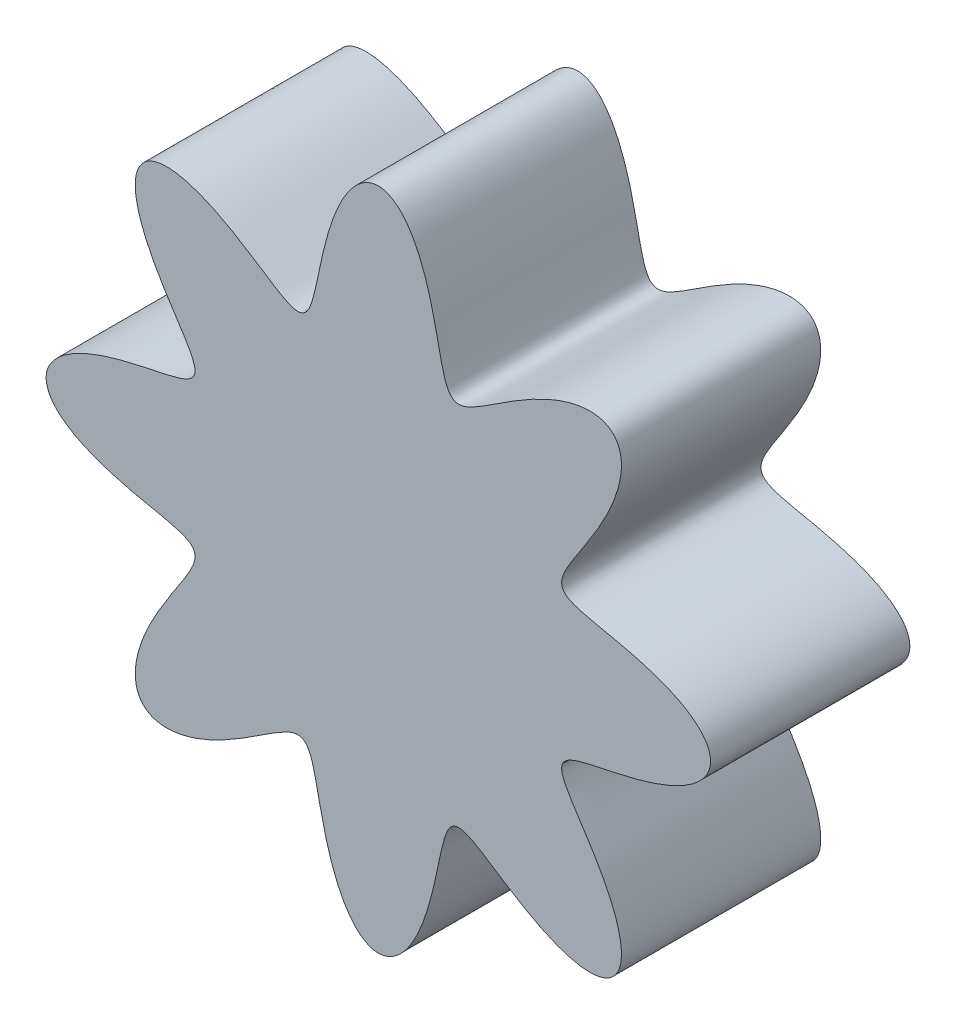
ISO-10303-21;
HEADER;
FILE_DESCRIPTION(('STEP AP214'),'2;1');
FILE_NAME('part.step','',(''),(''),'','','');
FILE_SCHEMA(('AUTOMOTIVE_DESIGN { 1 0 10303 214 1 1 1 1 }'));
ENDSEC;
DATA;
#1=APPLICATION_CONTEXT('core data for automotive mechanical design processes');
#2=APPLICATION_PROTOCOL_DEFINITION('international standard','automotive_design',2000,#1);
#3=PRODUCT_CONTEXT('',#1,'mechanical');
#4=PRODUCT('Part','Part','',(#3));
#5=PRODUCT_RELATED_PRODUCT_CATEGORY('part','',(#4));
#6=PRODUCT_DEFINITION_FORMATION('','',#4);
#7=PRODUCT_DEFINITION_CONTEXT('part definition',#1,'design');
#8=PRODUCT_DEFINITION('design','',#6,#7);
#9=PRODUCT_DEFINITION_SHAPE('','',#8);
#10=(LENGTH_UNIT() NAMED_UNIT(*) SI_UNIT(.MILLI.,.METRE.));
#11=(NAMED_UNIT(*) PLANE_ANGLE_UNIT() SI_UNIT($,.RADIAN.));
#12=(NAMED_UNIT(*) SI_UNIT($,.STERADIAN.) SOLID_ANGLE_UNIT());
#13=UNCERTAINTY_MEASURE_WITH_UNIT(LENGTH_MEASURE(1.E-05),#10,'distance_accuracy_value','');
#14=(GEOMETRIC_REPRESENTATION_CONTEXT(3) GLOBAL_UNCERTAINTY_ASSIGNED_CONTEXT((#13)) GLOBAL_UNIT_ASSIGNED_CONTEXT((#10,
#11,#12)) REPRESENTATION_CONTEXT('',''));
#15=CARTESIAN_POINT('',(0.,0.,0.));
#16=DIRECTION('',(0.,0.,1.));
#17=DIRECTION('',(1.,0.,0.));
#18=AXIS2_PLACEMENT_3D('',#15,#16,#17);
#19=CARTESIAN_POINT('',(127.,0.,38.1));
#20=CARTESIAN_POINT('',(127.,0.744327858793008,38.1));
#21=CARTESIAN_POINT('',(126.812104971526,2.26553497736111,38.1));
#22=CARTESIAN_POINT('',(125.986272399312,4.48764733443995,38.1));
#23=CARTESIAN_POINT('',(124.645591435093,6.63682299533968,38.1));
#24=CARTESIAN_POINT('',(122.825734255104,8.69471257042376,38.1));
#25=CARTESIAN_POINT('',(120.564985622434,10.6467449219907,38.1));
#26=CARTESIAN_POINT('',(117.906803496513,12.4795993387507,38.1));
#27=CARTESIAN_POINT('',(114.901276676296,14.1817557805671,38.1));
#28=CARTESIAN_POINT('',(111.605029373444,15.7446854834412,38.1));
#29=CARTESIAN_POINT('',(108.080250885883,17.1638059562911,38.1));
#30=CARTESIAN_POINT('',(104.393338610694,18.439077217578,38.1));
#31=CARTESIAN_POINT('',(100.613380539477,19.5752934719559,38.1));
#32=CARTESIAN_POINT('',(96.8105770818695,20.5821323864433,38.1));
#33=CARTESIAN_POINT('',(93.0546510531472,21.4740014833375,38.1));
#34=CARTESIAN_POINT('',(89.413276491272,22.2697095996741,38.1));
#35=CARTESIAN_POINT('',(85.950544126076,22.9919797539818,38.1));
#36=CARTESIAN_POINT('',(82.7254677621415,23.6668333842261,38.1));
#37=CARTESIAN_POINT('',(79.7904980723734,24.3228607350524,38.1));
#38=CARTESIAN_POINT('',(77.1899683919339,24.9905710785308,38.1));
#39=CARTESIAN_POINT('',(74.9582472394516,25.7018944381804,38.1));
#40=CARTESIAN_POINT('',(73.1177427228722,26.4917881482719,38.1));
#41=CARTESIAN_POINT('',(71.6787113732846,27.4021927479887,38.1));
#42=CARTESIAN_POINT('',(70.6559272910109,28.4955537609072,38.1));
#43=CARTESIAN_POINT('',(70.1106846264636,29.8118860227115,38.1));
#44=CARTESIAN_POINT('',(70.0607791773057,31.3082265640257,38.1));
#45=CARTESIAN_POINT('',(70.4345747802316,32.9695286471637,38.1));
#46=CARTESIAN_POINT('',(71.1774687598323,34.8295010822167,38.1));
#47=CARTESIAN_POINT('',(72.2525524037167,36.910547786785,38.1));
#48=CARTESIAN_POINT('',(73.6192620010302,39.221542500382,38.1));
#49=CARTESIAN_POINT('',(75.2307176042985,41.7607608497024,38.1));
#50=CARTESIAN_POINT('',(77.0339973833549,44.5184278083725,38.1));
#51=CARTESIAN_POINT('',(78.9717968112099,47.4776714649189,38.1));
#52=CARTESIAN_POINT('',(80.9839868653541,50.6151627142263,38.1));
#53=CARTESIAN_POINT('',(83.0091809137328,53.9016501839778,38.1));
#54=CARTESIAN_POINT('',(84.9862264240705,57.3025808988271,38.1));
#55=CARTESIAN_POINT('',(86.8556341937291,60.7788410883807,38.1));
#56=CARTESIAN_POINT('',(88.5609218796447,64.2876347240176,38.1));
#57=CARTESIAN_POINT('',(90.0498469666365,67.7834991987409,38.1));
#58=CARTESIAN_POINT('',(91.2754875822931,71.2194562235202,38.1));
#59=CARTESIAN_POINT('',(92.1971096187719,74.5482909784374,38.1));
#60=CARTESIAN_POINT('',(92.7807044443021,77.7239333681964,38.1));
#61=CARTESIAN_POINT('',(92.9989998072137,80.7028193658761,38.1));
#62=CARTESIAN_POINT('',(92.8306855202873,83.444800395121,38.1));
#63=CARTESIAN_POINT('',(92.2589934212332,85.9125016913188,38.1));
#64=CARTESIAN_POINT('',(91.2716744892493,88.0677242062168,38.1));
#65=CARTESIAN_POINT('',(89.8675706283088,89.8675706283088,38.1));
#66=CARTESIAN_POINT('',(88.0677242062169,91.2716744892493,38.1));
#67=CARTESIAN_POINT('',(85.9125016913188,92.2589934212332,38.1));
#68=CARTESIAN_POINT('',(83.444800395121,92.8306855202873,38.1));
#69=CARTESIAN_POINT('',(80.7028193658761,92.9989998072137,38.1));
#70=CARTESIAN_POINT('',(77.7239333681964,92.780704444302,38.1));
#71=CARTESIAN_POINT('',(74.5482909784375,92.1971096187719,38.1));
#72=CARTESIAN_POINT('',(71.2194562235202,91.275487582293,38.1));
#73=CARTESIAN_POINT('',(67.7834991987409,90.0498469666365,38.1));
#74=CARTESIAN_POINT('',(64.2876347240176,88.5609218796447,38.1));
#75=CARTESIAN_POINT('',(60.7788410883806,86.855634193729,38.1));
#76=CARTESIAN_POINT('',(57.3025808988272,84.9862264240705,38.1));
#77=CARTESIAN_POINT('',(53.9016501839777,83.0091809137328,38.1));
#78=CARTESIAN_POINT('',(50.6151627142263,80.9839868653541,38.1));
#79=CARTESIAN_POINT('',(47.477671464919,78.97179681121,38.1));
#80=CARTESIAN_POINT('',(44.5184278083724,77.0339973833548,38.1));
#81=CARTESIAN_POINT('',(41.7607608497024,75.2307176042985,38.1));
#82=CARTESIAN_POINT('',(39.221542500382,73.6192620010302,38.1));
#83=CARTESIAN_POINT('',(36.910547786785,72.2525524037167,38.1));
#84=CARTESIAN_POINT('',(34.8295010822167,71.1774687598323,38.1));
#85=CARTESIAN_POINT('',(32.9695286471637,70.4345747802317,38.1));
#86=CARTESIAN_POINT('',(31.3082265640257,70.0607791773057,38.1));
#87=CARTESIAN_POINT('',(29.8118860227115,70.1106846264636,38.1));
#88=CARTESIAN_POINT('',(28.4955537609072,70.655927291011,38.1));
#89=CARTESIAN_POINT('',(27.4021927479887,71.6787113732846,38.1));
#90=CARTESIAN_POINT('',(26.4917881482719,73.1177427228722,38.1));
#91=CARTESIAN_POINT('',(25.7018944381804,74.9582472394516,38.1));
#92=CARTESIAN_POINT('',(24.9905710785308,77.1899683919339,38.1));
#93=CARTESIAN_POINT('',(24.3228607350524,79.7904980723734,38.1));
#94=CARTESIAN_POINT('',(23.6668333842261,82.7254677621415,38.1));
#95=CARTESIAN_POINT('',(22.9919797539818,85.950544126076,38.1));
#96=CARTESIAN_POINT('',(22.2697095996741,89.413276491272,38.1));
#97=CARTESIAN_POINT('',(21.4740014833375,93.0546510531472,38.1));
#98=CARTESIAN_POINT('',(20.5821323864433,96.8105770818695,38.1));
#99=CARTESIAN_POINT('',(19.5752934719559,100.613380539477,38.1));
#100=CARTESIAN_POINT('',(18.439077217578,104.393338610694,38.1));
#101=CARTESIAN_POINT('',(17.1638059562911,108.080250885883,38.1));
#102=CARTESIAN_POINT('',(15.7446854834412,111.605029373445,38.1));
#103=CARTESIAN_POINT('',(14.1817557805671,114.901276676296,38.1));
#104=CARTESIAN_POINT('',(12.4795993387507,117.906803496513,38.1));
#105=CARTESIAN_POINT('',(10.6467449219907,120.564985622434,38.1));
#106=CARTESIAN_POINT('',(8.69471257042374,122.825734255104,38.1));
#107=CARTESIAN_POINT('',(6.63682299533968,124.645591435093,38.1));
#108=CARTESIAN_POINT('',(4.48764733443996,125.986272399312,38.1));
#109=CARTESIAN_POINT('',(2.26553497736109,126.812104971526,38.1));
#110=CARTESIAN_POINT('',(0.,127.091937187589,38.1));
#111=CARTESIAN_POINT('',(-2.2655349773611,126.812104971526,38.1));
#112=CARTESIAN_POINT('',(-4.48764733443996,125.986272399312,38.1));
#113=CARTESIAN_POINT('',(-6.63682299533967,124.645591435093,38.1));
#114=CARTESIAN_POINT('',(-8.69471257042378,122.825734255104,38.1));
#115=CARTESIAN_POINT('',(-10.6467449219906,120.564985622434,38.1));
#116=CARTESIAN_POINT('',(-12.4795993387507,117.906803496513,38.1));
#117=CARTESIAN_POINT('',(-14.1817557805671,114.901276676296,38.1));
#118=CARTESIAN_POINT('',(-15.7446854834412,111.605029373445,38.1));
#119=CARTESIAN_POINT('',(-17.1638059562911,108.080250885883,38.1));
#120=CARTESIAN_POINT('',(-18.439077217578,104.393338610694,38.1));
#121=CARTESIAN_POINT('',(-19.5752934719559,100.613380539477,38.1));
#122=CARTESIAN_POINT('',(-20.5821323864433,96.8105770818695,38.1));
#123=CARTESIAN_POINT('',(-21.4740014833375,93.0546510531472,38.1));
#124=CARTESIAN_POINT('',(-22.2697095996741,89.413276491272,38.1));
#125=CARTESIAN_POINT('',(-22.9919797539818,85.950544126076,38.1));
#126=CARTESIAN_POINT('',(-23.6668333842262,82.7254677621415,38.1));
#127=CARTESIAN_POINT('',(-24.3228607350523,79.7904980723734,38.1));
#128=CARTESIAN_POINT('',(-24.9905710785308,77.1899683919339,38.1));
#129=CARTESIAN_POINT('',(-25.7018944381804,74.9582472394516,38.1));
#130=CARTESIAN_POINT('',(-26.4917881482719,73.1177427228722,38.1));
#131=CARTESIAN_POINT('',(-27.4021927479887,71.6787113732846,38.1));
#132=CARTESIAN_POINT('',(-28.4955537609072,70.6559272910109,38.1));
#133=CARTESIAN_POINT('',(-29.8118860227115,70.1106846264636,38.1));
#134=CARTESIAN_POINT('',(-31.3082265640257,70.0607791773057,38.1));
#135=CARTESIAN_POINT('',(-32.9695286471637,70.4345747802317,38.1));
#136=CARTESIAN_POINT('',(-34.8295010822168,71.1774687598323,38.1));
#137=CARTESIAN_POINT('',(-36.910547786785,72.2525524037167,38.1));
#138=CARTESIAN_POINT('',(-39.221542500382,73.6192620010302,38.1));
#139=CARTESIAN_POINT('',(-41.7607608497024,75.2307176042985,38.1));
#140=CARTESIAN_POINT('',(-44.5184278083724,77.0339973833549,38.1));
#141=CARTESIAN_POINT('',(-47.4776714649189,78.9717968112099,38.1));
#142=CARTESIAN_POINT('',(-50.6151627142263,80.9839868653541,38.1));
#143=CARTESIAN_POINT('',(-53.9016501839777,83.0091809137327,38.1));
#144=CARTESIAN_POINT('',(-57.3025808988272,84.9862264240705,38.1));
#145=CARTESIAN_POINT('',(-60.7788410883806,86.855634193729,38.1));
#146=CARTESIAN_POINT('',(-64.2876347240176,88.5609218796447,38.1));
#147=CARTESIAN_POINT('',(-67.7834991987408,90.0498469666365,38.1));
#148=CARTESIAN_POINT('',(-71.2194562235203,91.2754875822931,38.1));
#149=CARTESIAN_POINT('',(-74.5482909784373,92.1971096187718,38.1));
#150=CARTESIAN_POINT('',(-77.7239333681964,92.7807044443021,38.1));
#151=CARTESIAN_POINT('',(-80.7028193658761,92.9989998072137,38.1));
#152=CARTESIAN_POINT('',(-83.444800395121,92.8306855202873,38.1));
#153=CARTESIAN_POINT('',(-85.9125016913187,92.2589934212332,38.1));
#154=CARTESIAN_POINT('',(-88.0677242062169,91.2716744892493,38.1));
#155=CARTESIAN_POINT('',(-89.8675706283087,89.8675706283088,38.1));
#156=CARTESIAN_POINT('',(-91.2716744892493,88.0677242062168,38.1));
#157=CARTESIAN_POINT('',(-92.2589934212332,85.9125016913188,38.1));
#158=CARTESIAN_POINT('',(-92.8306855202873,83.444800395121,38.1));
#159=CARTESIAN_POINT('',(-92.9989998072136,80.7028193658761,38.1));
#160=CARTESIAN_POINT('',(-92.7807044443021,77.7239333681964,38.1));
#161=CARTESIAN_POINT('',(-92.1971096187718,74.5482909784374,38.1));
#162=CARTESIAN_POINT('',(-91.2754875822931,71.2194562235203,38.1));
#163=CARTESIAN_POINT('',(-90.0498469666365,67.7834991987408,38.1));
#164=CARTESIAN_POINT('',(-88.5609218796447,64.2876347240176,38.1));
#165=CARTESIAN_POINT('',(-86.855634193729,60.7788410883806,38.1));
#166=CARTESIAN_POINT('',(-84.9862264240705,57.3025808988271,38.1));
#167=CARTESIAN_POINT('',(-83.0091809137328,53.9016501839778,38.1));
#168=CARTESIAN_POINT('',(-80.9839868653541,50.6151627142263,38.1));
#169=CARTESIAN_POINT('',(-78.97179681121,47.477671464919,38.1));
#170=CARTESIAN_POINT('',(-77.0339973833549,44.5184278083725,38.1));
#171=CARTESIAN_POINT('',(-75.2307176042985,41.7607608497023,38.1));
#172=CARTESIAN_POINT('',(-73.6192620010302,39.221542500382,38.1));
#173=CARTESIAN_POINT('',(-72.2525524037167,36.910547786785,38.1));
#174=CARTESIAN_POINT('',(-71.1774687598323,34.8295010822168,38.1));
#175=CARTESIAN_POINT('',(-70.4345747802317,32.9695286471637,38.1));
#176=CARTESIAN_POINT('',(-70.0607791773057,31.3082265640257,38.1));
#177=CARTESIAN_POINT('',(-70.1106846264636,29.8118860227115,38.1));
#178=CARTESIAN_POINT('',(-70.655927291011,28.4955537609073,38.1));
#179=CARTESIAN_POINT('',(-71.6787113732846,27.4021927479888,38.1));
#180=CARTESIAN_POINT('',(-73.1177427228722,26.4917881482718,38.1));
#181=CARTESIAN_POINT('',(-74.9582472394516,25.7018944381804,38.1));
#182=CARTESIAN_POINT('',(-77.1899683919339,24.9905710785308,38.1));
#183=CARTESIAN_POINT('',(-79.7904980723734,24.3228607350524,38.1));
#184=CARTESIAN_POINT('',(-82.7254677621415,23.6668333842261,38.1));
#185=CARTESIAN_POINT('',(-85.950544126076,22.9919797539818,38.1));
#186=CARTESIAN_POINT('',(-89.4132764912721,22.2697095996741,38.1));
#187=CARTESIAN_POINT('',(-93.0546510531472,21.4740014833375,38.1));
#188=CARTESIAN_POINT('',(-96.8105770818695,20.5821323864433,38.1));
#189=CARTESIAN_POINT('',(-100.613380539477,19.5752934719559,38.1));
#190=CARTESIAN_POINT('',(-104.393338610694,18.439077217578,38.1));
#191=CARTESIAN_POINT('',(-108.080250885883,17.1638059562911,38.1));
#192=CARTESIAN_POINT('',(-111.605029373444,15.7446854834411,38.1));
#193=CARTESIAN_POINT('',(-114.901276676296,14.1817557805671,38.1));
#194=CARTESIAN_POINT('',(-117.906803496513,12.4795993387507,38.1));
#195=CARTESIAN_POINT('',(-120.564985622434,10.6467449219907,38.1));
#196=CARTESIAN_POINT('',(-122.825734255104,8.69471257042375,38.1));
#197=CARTESIAN_POINT('',(-124.645591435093,6.63682299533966,38.1));
#198=CARTESIAN_POINT('',(-125.986272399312,4.48764733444,38.1));
#199=CARTESIAN_POINT('',(-126.812104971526,2.26553497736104,38.1));
#200=CARTESIAN_POINT('',(-127.091937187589,1.14763307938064E-13,38.1));
#201=CARTESIAN_POINT('',(-126.812104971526,-2.26553497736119,38.1));
#202=CARTESIAN_POINT('',(-125.986272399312,-4.48764733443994,38.1));
#203=CARTESIAN_POINT('',(-124.645591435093,-6.63682299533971,38.1));
#204=CARTESIAN_POINT('',(-122.825734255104,-8.69471257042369,38.1));
#205=CARTESIAN_POINT('',(-120.564985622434,-10.6467449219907,38.1));
#206=CARTESIAN_POINT('',(-117.906803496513,-12.4795993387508,38.1));
#207=CARTESIAN_POINT('',(-114.901276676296,-14.181755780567,38.1));
#208=CARTESIAN_POINT('',(-111.605029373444,-15.7446854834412,38.1));
#209=CARTESIAN_POINT('',(-108.080250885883,-17.1638059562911,38.1));
#210=CARTESIAN_POINT('',(-104.393338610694,-18.4390772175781,38.1));
#211=CARTESIAN_POINT('',(-100.613380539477,-19.5752934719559,38.1));
#212=CARTESIAN_POINT('',(-96.8105770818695,-20.5821323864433,38.1));
#213=CARTESIAN_POINT('',(-93.0546510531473,-21.4740014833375,38.1));
#214=CARTESIAN_POINT('',(-89.4132764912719,-22.2697095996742,38.1));
#215=CARTESIAN_POINT('',(-85.950544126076,-22.9919797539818,38.1));
#216=CARTESIAN_POINT('',(-82.7254677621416,-23.6668333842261,38.1));
#217=CARTESIAN_POINT('',(-79.7904980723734,-24.3228607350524,38.1));
#218=CARTESIAN_POINT('',(-77.1899683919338,-24.9905710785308,38.1));
#219=CARTESIAN_POINT('',(-74.9582472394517,-25.7018944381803,38.1));
#220=CARTESIAN_POINT('',(-73.1177427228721,-26.4917881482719,38.1));
#221=CARTESIAN_POINT('',(-71.6787113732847,-27.4021927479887,38.1));
#222=CARTESIAN_POINT('',(-70.6559272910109,-28.4955537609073,38.1));
#223=CARTESIAN_POINT('',(-70.1106846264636,-29.8118860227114,38.1));
#224=CARTESIAN_POINT('',(-70.0607791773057,-31.3082265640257,38.1));
#225=CARTESIAN_POINT('',(-70.4345747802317,-32.9695286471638,38.1));
#226=CARTESIAN_POINT('',(-71.1774687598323,-34.8295010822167,38.1));
#227=CARTESIAN_POINT('',(-72.2525524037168,-36.9105477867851,38.1));
#228=CARTESIAN_POINT('',(-73.6192620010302,-39.221542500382,38.1));
#229=CARTESIAN_POINT('',(-75.2307176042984,-41.7607608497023,38.1));
#230=CARTESIAN_POINT('',(-77.0339973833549,-44.5184278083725,38.1));
#231=CARTESIAN_POINT('',(-78.9717968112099,-47.4776714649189,38.1));
#232=CARTESIAN_POINT('',(-80.9839868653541,-50.6151627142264,38.1));
#233=CARTESIAN_POINT('',(-83.0091809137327,-53.9016501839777,38.1));
#234=CARTESIAN_POINT('',(-84.9862264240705,-57.3025808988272,38.1));
#235=CARTESIAN_POINT('',(-86.855634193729,-60.7788410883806,38.1));
#236=CARTESIAN_POINT('',(-88.5609218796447,-64.2876347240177,38.1));
#237=CARTESIAN_POINT('',(-90.0498469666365,-67.7834991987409,38.1));
#238=CARTESIAN_POINT('',(-91.275487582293,-71.2194562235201,38.1));
#239=CARTESIAN_POINT('',(-92.1971096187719,-74.5482909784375,38.1));
#240=CARTESIAN_POINT('',(-92.7807044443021,-77.7239333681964,38.1));
#241=CARTESIAN_POINT('',(-92.9989998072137,-80.7028193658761,38.1));
#242=CARTESIAN_POINT('',(-92.8306855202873,-83.444800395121,38.1));
#243=CARTESIAN_POINT('',(-92.2589934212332,-85.9125016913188,38.1));
#244=CARTESIAN_POINT('',(-91.2716744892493,-88.0677242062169,38.1));
#245=CARTESIAN_POINT('',(-89.8675706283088,-89.8675706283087,38.1));
#246=CARTESIAN_POINT('',(-88.0677242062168,-91.2716744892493,38.1));
#247=CARTESIAN_POINT('',(-85.9125016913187,-92.2589934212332,38.1));
#248=CARTESIAN_POINT('',(-83.4448003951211,-92.8306855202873,38.1));
#249=CARTESIAN_POINT('',(-80.702819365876,-92.9989998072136,38.1));
#250=CARTESIAN_POINT('',(-77.7239333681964,-92.7807044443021,38.1));
#251=CARTESIAN_POINT('',(-74.5482909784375,-92.1971096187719,38.1));
#252=CARTESIAN_POINT('',(-71.2194562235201,-91.275487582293,38.1));
#253=CARTESIAN_POINT('',(-67.7834991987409,-90.0498469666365,38.1));
#254=CARTESIAN_POINT('',(-64.2876347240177,-88.5609218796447,38.1));
#255=CARTESIAN_POINT('',(-60.7788410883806,-86.855634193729,38.1));
#256=CARTESIAN_POINT('',(-57.3025808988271,-84.9862264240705,38.1));
#257=CARTESIAN_POINT('',(-53.9016501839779,-83.0091809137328,38.1));
#258=CARTESIAN_POINT('',(-50.6151627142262,-80.983986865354,38.1));
#259=CARTESIAN_POINT('',(-47.4776714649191,-78.97179681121,38.1));
#260=CARTESIAN_POINT('',(-44.5184278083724,-77.0339973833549,38.1));
#261=CARTESIAN_POINT('',(-41.7607608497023,-75.2307176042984,38.1));
#262=CARTESIAN_POINT('',(-39.221542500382,-73.6192620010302,38.1));
#263=CARTESIAN_POINT('',(-36.9105477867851,-72.2525524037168,38.1));
#264=CARTESIAN_POINT('',(-34.8295010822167,-71.1774687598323,38.1));
#265=CARTESIAN_POINT('',(-32.9695286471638,-70.4345747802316,38.1));
#266=CARTESIAN_POINT('',(-31.3082265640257,-70.0607791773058,38.1));
#267=CARTESIAN_POINT('',(-29.8118860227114,-70.1106846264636,38.1));
#268=CARTESIAN_POINT('',(-28.4955537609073,-70.6559272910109,38.1));
#269=CARTESIAN_POINT('',(-27.4021927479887,-71.6787113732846,38.1));
#270=CARTESIAN_POINT('',(-26.4917881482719,-73.1177427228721,38.1));
#271=CARTESIAN_POINT('',(-25.7018944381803,-74.9582472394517,38.1));
#272=CARTESIAN_POINT('',(-24.9905710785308,-77.1899683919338,38.1));
#273=CARTESIAN_POINT('',(-24.3228607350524,-79.7904980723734,38.1));
#274=CARTESIAN_POINT('',(-23.6668333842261,-82.7254677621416,38.1));
#275=CARTESIAN_POINT('',(-22.9919797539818,-85.950544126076,38.1));
#276=CARTESIAN_POINT('',(-22.2697095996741,-89.413276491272,38.1));
#277=CARTESIAN_POINT('',(-21.4740014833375,-93.0546510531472,38.1));
#278=CARTESIAN_POINT('',(-20.5821323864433,-96.8105770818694,38.1));
#279=CARTESIAN_POINT('',(-19.5752934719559,-100.613380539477,38.1));
#280=CARTESIAN_POINT('',(-18.439077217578,-104.393338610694,38.1));
#281=CARTESIAN_POINT('',(-17.1638059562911,-108.080250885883,38.1));
#282=CARTESIAN_POINT('',(-15.7446854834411,-111.605029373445,38.1));
#283=CARTESIAN_POINT('',(-14.181755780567,-114.901276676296,38.1));
#284=CARTESIAN_POINT('',(-12.4795993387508,-117.906803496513,38.1));
#285=CARTESIAN_POINT('',(-10.6467449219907,-120.564985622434,38.1));
#286=CARTESIAN_POINT('',(-8.69471257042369,-122.825734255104,38.1));
#287=CARTESIAN_POINT('',(-6.63682299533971,-124.645591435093,38.1));
#288=CARTESIAN_POINT('',(-4.48764733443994,-125.986272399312,38.1));
#289=CARTESIAN_POINT('',(-2.26553497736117,-126.812104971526,38.1));
#290=CARTESIAN_POINT('',(0.,-127.091937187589,38.1));
#291=CARTESIAN_POINT('',(2.2655349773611,-126.812104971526,38.1));
#292=CARTESIAN_POINT('',(4.48764733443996,-125.986272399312,38.1));
#293=CARTESIAN_POINT('',(6.63682299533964,-124.645591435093,38.1));
#294=CARTESIAN_POINT('',(8.69471257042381,-122.825734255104,38.1));
#295=CARTESIAN_POINT('',(10.6467449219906,-120.564985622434,38.1));
#296=CARTESIAN_POINT('',(12.4795993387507,-117.906803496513,38.1));
#297=CARTESIAN_POINT('',(14.1817557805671,-114.901276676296,38.1));
#298=CARTESIAN_POINT('',(15.7446854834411,-111.605029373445,38.1));
#299=CARTESIAN_POINT('',(17.1638059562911,-108.080250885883,38.1));
#300=CARTESIAN_POINT('',(18.439077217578,-104.393338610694,38.1));
#301=CARTESIAN_POINT('',(19.5752934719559,-100.613380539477,38.1));
#302=CARTESIAN_POINT('',(20.5821323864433,-96.8105770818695,38.1));
#303=CARTESIAN_POINT('',(21.4740014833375,-93.0546510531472,38.1));
#304=CARTESIAN_POINT('',(22.2697095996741,-89.4132764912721,38.1));
#305=CARTESIAN_POINT('',(22.9919797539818,-85.9505441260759,38.1));
#306=CARTESIAN_POINT('',(23.6668333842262,-82.7254677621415,38.1));
#307=CARTESIAN_POINT('',(24.3228607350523,-79.7904980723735,38.1));
#308=CARTESIAN_POINT('',(24.9905710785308,-77.1899683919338,38.1));
#309=CARTESIAN_POINT('',(25.7018944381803,-74.9582472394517,38.1));
#310=CARTESIAN_POINT('',(26.4917881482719,-73.1177427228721,38.1));
#311=CARTESIAN_POINT('',(27.4021927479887,-71.6787113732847,38.1));
#312=CARTESIAN_POINT('',(28.4955537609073,-70.6559272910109,38.1));
#313=CARTESIAN_POINT('',(29.8118860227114,-70.1106846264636,38.1));
#314=CARTESIAN_POINT('',(31.3082265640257,-70.0607791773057,38.1));
#315=CARTESIAN_POINT('',(32.9695286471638,-70.4345747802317,38.1));
#316=CARTESIAN_POINT('',(34.8295010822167,-71.1774687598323,38.1));
#317=CARTESIAN_POINT('',(36.9105477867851,-72.2525524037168,38.1));
#318=CARTESIAN_POINT('',(39.221542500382,-73.6192620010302,38.1));
#319=CARTESIAN_POINT('',(41.7607608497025,-75.2307176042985,38.1));
#320=CARTESIAN_POINT('',(44.5184278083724,-77.0339973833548,38.1));
#321=CARTESIAN_POINT('',(47.477671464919,-78.97179681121,38.1));
#322=CARTESIAN_POINT('',(50.6151627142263,-80.9839868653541,38.1));
#323=CARTESIAN_POINT('',(53.9016501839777,-83.0091809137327,38.1));
#324=CARTESIAN_POINT('',(57.3025808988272,-84.9862264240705,38.1));
#325=CARTESIAN_POINT('',(60.7788410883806,-86.8556341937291,38.1));
#326=CARTESIAN_POINT('',(64.2876347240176,-88.5609218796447,38.1));
#327=CARTESIAN_POINT('',(67.7834991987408,-90.0498469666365,38.1));
#328=CARTESIAN_POINT('',(71.2194562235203,-91.2754875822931,38.1));
#329=CARTESIAN_POINT('',(74.5482909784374,-92.1971096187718,38.1));
#330=CARTESIAN_POINT('',(77.7239333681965,-92.7807044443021,38.1));
#331=CARTESIAN_POINT('',(80.702819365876,-92.9989998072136,38.1));
#332=CARTESIAN_POINT('',(83.4448003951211,-92.8306855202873,38.1));
#333=CARTESIAN_POINT('',(85.9125016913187,-92.2589934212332,38.1));
#334=CARTESIAN_POINT('',(88.0677242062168,-91.2716744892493,38.1));
#335=CARTESIAN_POINT('',(89.8675706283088,-89.8675706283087,38.1));
#336=CARTESIAN_POINT('',(91.2716744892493,-88.0677242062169,38.1));
#337=CARTESIAN_POINT('',(92.2589934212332,-85.9125016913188,38.1));
#338=CARTESIAN_POINT('',(92.8306855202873,-83.444800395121,38.1));
#339=CARTESIAN_POINT('',(92.9989998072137,-80.7028193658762,38.1));
#340=CARTESIAN_POINT('',(92.780704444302,-77.7239333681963,38.1));
#341=CARTESIAN_POINT('',(92.1971096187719,-74.5482909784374,38.1));
#342=CARTESIAN_POINT('',(91.2754875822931,-71.2194562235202,38.1));
#343=CARTESIAN_POINT('',(90.0498469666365,-67.7834991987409,38.1));
#344=CARTESIAN_POINT('',(88.5609218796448,-64.2876347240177,38.1));
#345=CARTESIAN_POINT('',(86.855634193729,-60.7788410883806,38.1));
#346=CARTESIAN_POINT('',(84.9862264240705,-57.3025808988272,38.1));
#347=CARTESIAN_POINT('',(83.0091809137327,-53.9016501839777,38.1));
#348=CARTESIAN_POINT('',(80.9839868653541,-50.6151627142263,38.1));
#349=CARTESIAN_POINT('',(78.9717968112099,-47.4776714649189,38.1));
#350=CARTESIAN_POINT('',(77.0339973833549,-44.5184278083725,38.1));
#351=CARTESIAN_POINT('',(75.2307176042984,-41.7607608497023,38.1));
#352=CARTESIAN_POINT('',(73.6192620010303,-39.2215425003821,38.1));
#353=CARTESIAN_POINT('',(72.2525524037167,-36.910547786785,38.1));
#354=CARTESIAN_POINT('',(71.1774687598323,-34.8295010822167,38.1));
#355=CARTESIAN_POINT('',(70.4345747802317,-32.9695286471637,38.1));
#356=CARTESIAN_POINT('',(70.0607791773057,-31.3082265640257,38.1));
#357=CARTESIAN_POINT('',(70.1106846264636,-29.8118860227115,38.1));
#358=CARTESIAN_POINT('',(70.655927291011,-28.4955537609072,38.1));
#359=CARTESIAN_POINT('',(71.6787113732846,-27.4021927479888,38.1));
#360=CARTESIAN_POINT('',(73.1177427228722,-26.4917881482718,38.1));
#361=CARTESIAN_POINT('',(74.9582472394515,-25.7018944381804,38.1));
#362=CARTESIAN_POINT('',(77.1899683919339,-24.9905710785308,38.1));
#363=CARTESIAN_POINT('',(79.7904980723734,-24.3228607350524,38.1));
#364=CARTESIAN_POINT('',(82.7254677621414,-23.6668333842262,38.1));
#365=CARTESIAN_POINT('',(85.9505441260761,-22.9919797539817,38.1));
#366=CARTESIAN_POINT('',(89.4132764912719,-22.2697095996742,38.1));
#367=CARTESIAN_POINT('',(93.0546510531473,-21.4740014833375,38.1));
#368=CARTESIAN_POINT('',(96.8105770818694,-20.5821323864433,38.1));
#369=CARTESIAN_POINT('',(100.613380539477,-19.5752934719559,38.1));
#370=CARTESIAN_POINT('',(104.393338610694,-18.4390772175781,38.1));
#371=CARTESIAN_POINT('',(108.080250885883,-17.163805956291,38.1));
#372=CARTESIAN_POINT('',(111.605029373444,-15.7446854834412,38.1));
#373=CARTESIAN_POINT('',(114.901276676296,-14.181755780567,38.1));
#374=CARTESIAN_POINT('',(117.906803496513,-12.4795993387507,38.1));
#375=CARTESIAN_POINT('',(120.564985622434,-10.6467449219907,38.1));
#376=CARTESIAN_POINT('',(122.825734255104,-8.69471257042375,38.1));
#377=CARTESIAN_POINT('',(124.645591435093,-6.63682299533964,38.1));
#378=CARTESIAN_POINT('',(125.986272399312,-4.48764733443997,38.1));
#379=CARTESIAN_POINT('',(126.812104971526,-2.26553497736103,38.1));
#380=CARTESIAN_POINT('',(127.,-0.744327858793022,38.1));
#381=CARTESIAN_POINT('',(127.,0.,38.1));
#382=B_SPLINE_CURVE_WITH_KNOTS('',3,(#19,#20,#21,#22,#23,#24,#25,#26,#27,#28,#29,#30,#31,#32,
#33,#34,#35,#36,#37,#38,#39,#40,#41,#42,#43,#44,#45,#46,#47,#48,#49,#50,#51,#52,#53,#54,#55,#56,
#57,#58,#59,#60,#61,#62,#63,#64,#65,#66,#67,#68,#69,#70,#71,#72,#73,#74,#75,#76,#77,#78,#79,#80,
#81,#82,#83,#84,#85,#86,#87,#88,#89,#90,#91,#92,#93,#94,#95,#96,#97,#98,#99,#100,#101,#102,#103,
#104,#105,#106,#107,#108,#109,#110,#111,#112,#113,#114,#115,#116,#117,#118,#119,#120,#121,#122,
#123,#124,#125,#126,#127,#128,#129,#130,#131,#132,#133,#134,#135,#136,#137,#138,#139,#140,#141,
#142,#143,#144,#145,#146,#147,#148,#149,#150,#151,#152,#153,#154,#155,#156,#157,#158,#159,#160,
#161,#162,#163,#164,#165,#166,#167,#168,#169,#170,#171,#172,#173,#174,#175,#176,#177,#178,#179,
#180,#181,#182,#183,#184,#185,#186,#187,#188,#189,#190,#191,#192,#193,#194,#195,#196,#197,#198,
#199,#200,#201,#202,#203,#204,#205,#206,#207,#208,#209,#210,#211,#212,#213,#214,#215,#216,#217,
#218,#219,#220,#221,#222,#223,#224,#225,#226,#227,#228,#229,#230,#231,#232,#233,#234,#235,#236,
#237,#238,#239,#240,#241,#242,#243,#244,#245,#246,#247,#248,#249,#250,#251,#252,#253,#254,#255,
#256,#257,#258,#259,#260,#261,#262,#263,#264,#265,#266,#267,#268,#269,#270,#271,#272,#273,#274,
#275,#276,#277,#278,#279,#280,#281,#282,#283,#284,#285,#286,#287,#288,#289,#290,#291,#292,#293,
#294,#295,#296,#297,#298,#299,#300,#301,#302,#303,#304,#305,#306,#307,#308,#309,#310,#311,#312,
#313,#314,#315,#316,#317,#318,#319,#320,#321,#322,#323,#324,#325,#326,#327,#328,#329,#330,#331,
#332,#333,#334,#335,#336,#337,#338,#339,#340,#341,#342,#343,#344,#345,#346,#347,#348,#349,#350,
#351,#352,#353,#354,#355,#356,#357,#358,#359,#360,#361,#362,#363,#364,#365,#366,#367,#368,#369,
#370,#371,#372,#373,#374,#375,#376,#377,#378,#379,#380,#381),.UNSPECIFIED.,.T.,.F.,(4,1,1,1,1,1,
1,1,1,1,1,1,1,1,1,1,1,1,1,1,1,1,1,1,1,1,1,1,1,1,1,1,1,1,1,1,1,1,1,1,1,1,1,1,1,1,1,1,1,1,1,1,1,1,
1,1,1,1,1,1,1,1,1,1,1,1,1,1,1,1,1,1,1,1,1,1,1,1,1,1,1,1,1,1,1,1,1,1,1,1,1,1,1,1,1,1,1,1,1,1,1,1,
1,1,1,1,1,1,1,1,1,1,1,1,1,1,1,1,1,1,1,1,1,1,1,1,1,1,1,1,1,1,1,1,1,1,1,1,1,1,1,1,1,1,1,1,1,1,1,1,
1,1,1,1,1,1,1,1,1,1,1,1,1,1,1,1,1,1,1,1,1,1,1,1,1,1,1,1,1,1,1,1,1,1,1,1,1,1,1,1,1,1,1,1,1,1,1,1,
1,1,1,1,1,1,1,1,1,1,1,1,1,1,1,1,1,1,1,1,1,1,1,1,1,1,1,1,1,1,1,1,1,1,1,1,1,1,1,1,1,1,1,1,1,1,1,1,
1,1,1,1,1,1,1,1,1,1,1,1,1,1,1,1,1,1,1,1,1,1,1,1,1,1,1,1,1,1,1,1,1,1,1,1,1,1,1,1,1,1,1,1,1,1,1,1,
1,1,1,1,1,1,1,1,1,1,1,1,1,1,1,1,1,1,1,1,1,1,1,1,1,1,1,1,1,1,1,1,1,1,1,1,1,1,1,1,1,1,1,1,1,1,1,1,
1,1,1,1,1,1,1,1,1,1,1,1,1,1,1,1,1,1,4),(0.,0.00207677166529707,0.00424436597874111,
0.00657632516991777,0.0091202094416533,0.0118975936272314,0.01490815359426,0.0181343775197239,
0.0215456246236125,0.0251013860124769,0.0287539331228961,0.032450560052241,0.0361355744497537,
0.0397521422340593,0.043244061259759,0.0465575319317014,0.049643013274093,0.0524573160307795,
0.0549662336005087,0.0571483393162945,0.0590012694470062,0.0605529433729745,0.0618797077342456,
0.0631202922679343,0.0644470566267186,0.0659987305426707,0.0678516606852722,0.0700337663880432,
0.0725426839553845,0.0753569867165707,0.0784424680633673,0.0817559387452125,0.0852478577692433,
0.0888644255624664,0.0925494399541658,0.0962460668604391,0.0998986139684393,0.103454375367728,
0.106865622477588,0.110091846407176,0.113102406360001,0.115879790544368,0.118423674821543,
0.120755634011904,0.122923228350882,0.125,0.127076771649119,0.129244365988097,0.131576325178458,
0.134120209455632,0.13689759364,0.139908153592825,0.143134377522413,0.146545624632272,
0.150101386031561,0.153753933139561,0.157450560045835,0.161135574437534,0.164752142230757,
0.168244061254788,0.171557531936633,0.17464301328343,0.177457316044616,0.179966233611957,
0.182148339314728,0.18400126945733,0.185552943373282,0.186879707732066,0.188120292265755,
0.189447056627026,0.190998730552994,0.192851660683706,0.195033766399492,0.197542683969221,
0.200356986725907,0.203442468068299,0.206755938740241,0.210247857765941,0.213864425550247,
0.217549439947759,0.221246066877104,0.224898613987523,0.228454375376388,0.231865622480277,
0.23509184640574,0.238102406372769,0.240879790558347,0.243423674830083,0.245755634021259,
0.247923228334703,0.25,0.252076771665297,0.254244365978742,0.256576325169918,0.259120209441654,
0.261897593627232,0.26490815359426,0.268134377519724,0.271545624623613,0.275101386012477,
0.278753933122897,0.282450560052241,0.286135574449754,0.28975214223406,0.293244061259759,
0.296557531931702,0.299643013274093,0.30245731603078,0.304966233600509,0.307148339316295,
0.309001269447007,0.310552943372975,0.311879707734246,0.313120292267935,0.314447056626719,
0.315998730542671,0.317851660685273,0.320033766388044,0.322542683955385,0.325356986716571,
0.328442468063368,0.331755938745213,0.335247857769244,0.338864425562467,0.342549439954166,
0.346246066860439,0.34989861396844,0.353454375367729,0.356865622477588,0.360091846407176,
0.363102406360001,0.365879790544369,0.368423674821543,0.370755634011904,0.372923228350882,0.375,
0.377076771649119,0.379244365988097,0.381576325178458,0.384120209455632,0.38689759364,
0.389908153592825,0.393134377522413,0.396545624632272,0.400101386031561,0.403753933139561,
0.407450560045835,0.411135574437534,0.414752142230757,0.418244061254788,0.421557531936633,
0.42464301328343,0.427457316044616,0.429966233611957,0.432148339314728,0.43400126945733,
0.435552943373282,0.436879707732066,0.438120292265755,0.439447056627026,0.440998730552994,
0.442851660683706,0.445033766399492,0.447542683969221,0.450356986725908,0.453442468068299,
0.456755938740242,0.460247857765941,0.463864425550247,0.46754943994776,0.471246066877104,
0.474898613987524,0.478454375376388,0.481865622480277,0.48509184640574,0.488102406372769,
0.490879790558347,0.493423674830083,0.495755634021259,0.497923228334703,0.5,0.502076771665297,
0.504244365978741,0.506576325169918,0.509120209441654,0.511897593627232,0.51490815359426,
0.518134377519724,0.521545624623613,0.525101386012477,0.528753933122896,0.532450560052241,
0.536135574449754,0.53975214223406,0.543244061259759,0.546557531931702,0.549643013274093,
0.55245731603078,0.554966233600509,0.557148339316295,0.559001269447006,0.560552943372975,
0.561879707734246,0.563120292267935,0.564447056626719,0.565998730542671,0.567851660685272,
0.570033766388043,0.572542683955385,0.575356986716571,0.578442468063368,0.581755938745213,
0.585247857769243,0.588864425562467,0.592549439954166,0.596246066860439,0.599898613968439,
0.603454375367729,0.606865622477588,0.610091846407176,0.613102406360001,0.615879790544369,
0.618423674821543,0.620755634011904,0.622923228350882,0.625,0.627076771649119,0.629244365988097,
0.631576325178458,0.634120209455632,0.63689759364,0.639908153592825,0.643134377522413,
0.646545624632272,0.650101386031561,0.653753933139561,0.657450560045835,0.661135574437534,
0.664752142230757,0.668244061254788,0.671557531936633,0.67464301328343,0.677457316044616,
0.679966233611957,0.682148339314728,0.68400126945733,0.685552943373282,0.686879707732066,
0.688120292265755,0.689447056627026,0.690998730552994,0.692851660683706,0.695033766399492,
0.697542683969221,0.700356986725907,0.703442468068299,0.706755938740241,0.710247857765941,
0.713864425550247,0.717549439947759,0.721246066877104,0.724898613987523,0.728454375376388,
0.731865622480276,0.73509184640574,0.738102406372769,0.740879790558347,0.743423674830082,
0.745755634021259,0.747923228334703,0.75,0.752076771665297,0.754244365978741,0.756576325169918,
0.759120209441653,0.761897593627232,0.76490815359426,0.768134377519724,0.771545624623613,
0.775101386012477,0.778753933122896,0.782450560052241,0.786135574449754,0.789752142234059,
0.793244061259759,0.796557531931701,0.799643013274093,0.80245731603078,0.804966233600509,
0.807148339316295,0.809001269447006,0.810552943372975,0.811879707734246,0.813120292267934,
0.814447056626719,0.815998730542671,0.817851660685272,0.820033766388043,0.822542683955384,
0.825356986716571,0.828442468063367,0.831755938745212,0.835247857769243,0.838864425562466,
0.842549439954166,0.846246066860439,0.849898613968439,0.853454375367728,0.856865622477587,
0.860091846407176,0.863102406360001,0.865879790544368,0.868423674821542,0.870755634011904,
0.872923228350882,0.875,0.877076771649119,0.879244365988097,0.881576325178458,0.884120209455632,
0.886897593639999,0.889908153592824,0.893134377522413,0.896545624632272,0.900101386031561,
0.903753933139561,0.907450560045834,0.911135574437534,0.914752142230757,0.918244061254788,
0.921557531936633,0.924643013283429,0.927457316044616,0.929966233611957,0.932148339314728,
0.93400126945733,0.935552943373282,0.936879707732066,0.938120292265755,0.939447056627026,
0.940998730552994,0.942851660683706,0.945033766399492,0.947542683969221,0.950356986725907,
0.953442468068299,0.956755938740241,0.960247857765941,0.963864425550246,0.967549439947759,
0.971246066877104,0.974898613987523,0.978454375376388,0.981865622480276,0.98509184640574,
0.988102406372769,0.990879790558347,0.993423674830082,0.995755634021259,0.997923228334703,1.),.UNSPECIFIED.);
#383=DIRECTION('',(0.,0.,-1.));
#384=VECTOR('',#383,1.);
#385=SURFACE_OF_LINEAR_EXTRUSION('',#382,#384);
#386=CARTESIAN_POINT('',(127.,0.,38.1));
#387=VERTEX_POINT('',#386);
#388=EDGE_CURVE('E10',#387,#387,#382,.T.);
#389=ORIENTED_EDGE('',*,*,#388,.F.);
#390=EDGE_LOOP('',(#389));
#391=FACE_BOUND('',#390,.T.);
#392=CARTESIAN_POINT('',(127.,0.,-38.1));
#393=CARTESIAN_POINT('',(127.,0.744327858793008,-38.1));
#394=CARTESIAN_POINT('',(126.812104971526,2.26553497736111,-38.1));
#395=CARTESIAN_POINT('',(125.986272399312,4.48764733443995,-38.1));
#396=CARTESIAN_POINT('',(124.645591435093,6.63682299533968,-38.1));
#397=CARTESIAN_POINT('',(122.825734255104,8.69471257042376,-38.1));
#398=CARTESIAN_POINT('',(120.564985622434,10.6467449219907,-38.1));
#399=CARTESIAN_POINT('',(117.906803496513,12.4795993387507,-38.1));
#400=CARTESIAN_POINT('',(114.901276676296,14.1817557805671,-38.1));
#401=CARTESIAN_POINT('',(111.605029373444,15.7446854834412,-38.1));
#402=CARTESIAN_POINT('',(108.080250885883,17.1638059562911,-38.1));
#403=CARTESIAN_POINT('',(104.393338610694,18.439077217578,-38.1));
#404=CARTESIAN_POINT('',(100.613380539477,19.5752934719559,-38.1));
#405=CARTESIAN_POINT('',(96.8105770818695,20.5821323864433,-38.1));
#406=CARTESIAN_POINT('',(93.0546510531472,21.4740014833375,-38.1));
#407=CARTESIAN_POINT('',(89.413276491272,22.2697095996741,-38.1));
#408=CARTESIAN_POINT('',(85.950544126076,22.9919797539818,-38.1));
#409=CARTESIAN_POINT('',(82.7254677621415,23.6668333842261,-38.1));
#410=CARTESIAN_POINT('',(79.7904980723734,24.3228607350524,-38.1));
#411=CARTESIAN_POINT('',(77.1899683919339,24.9905710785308,-38.1));
#412=CARTESIAN_POINT('',(74.9582472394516,25.7018944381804,-38.1));
#413=CARTESIAN_POINT('',(73.1177427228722,26.4917881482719,-38.1));
#414=CARTESIAN_POINT('',(71.6787113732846,27.4021927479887,-38.1));
#415=CARTESIAN_POINT('',(70.6559272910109,28.4955537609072,-38.1));
#416=CARTESIAN_POINT('',(70.1106846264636,29.8118860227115,-38.1));
#417=CARTESIAN_POINT('',(70.0607791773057,31.3082265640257,-38.1));
#418=CARTESIAN_POINT('',(70.4345747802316,32.9695286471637,-38.1));
#419=CARTESIAN_POINT('',(71.1774687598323,34.8295010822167,-38.1));
#420=CARTESIAN_POINT('',(72.2525524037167,36.910547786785,-38.1));
#421=CARTESIAN_POINT('',(73.6192620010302,39.221542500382,-38.1));
#422=CARTESIAN_POINT('',(75.2307176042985,41.7607608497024,-38.1));
#423=CARTESIAN_POINT('',(77.0339973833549,44.5184278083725,-38.1));
#424=CARTESIAN_POINT('',(78.9717968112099,47.4776714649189,-38.1));
#425=CARTESIAN_POINT('',(80.9839868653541,50.6151627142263,-38.1));
#426=CARTESIAN_POINT('',(83.0091809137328,53.9016501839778,-38.1));
#427=CARTESIAN_POINT('',(84.9862264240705,57.3025808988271,-38.1));
#428=CARTESIAN_POINT('',(86.8556341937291,60.7788410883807,-38.1));
#429=CARTESIAN_POINT('',(88.5609218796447,64.2876347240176,-38.1));
#430=CARTESIAN_POINT('',(90.0498469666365,67.7834991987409,-38.1));
#431=CARTESIAN_POINT('',(91.2754875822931,71.2194562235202,-38.1));
#432=CARTESIAN_POINT('',(92.1971096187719,74.5482909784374,-38.1));
#433=CARTESIAN_POINT('',(92.7807044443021,77.7239333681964,-38.1));
#434=CARTESIAN_POINT('',(92.9989998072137,80.7028193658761,-38.1));
#435=CARTESIAN_POINT('',(92.8306855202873,83.444800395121,-38.1));
#436=CARTESIAN_POINT('',(92.2589934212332,85.9125016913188,-38.1));
#437=CARTESIAN_POINT('',(91.2716744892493,88.0677242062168,-38.1));
#438=CARTESIAN_POINT('',(89.8675706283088,89.8675706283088,-38.1));
#439=CARTESIAN_POINT('',(88.0677242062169,91.2716744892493,-38.1));
#440=CARTESIAN_POINT('',(85.9125016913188,92.2589934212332,-38.1));
#441=CARTESIAN_POINT('',(83.444800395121,92.8306855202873,-38.1));
#442=CARTESIAN_POINT('',(80.7028193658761,92.9989998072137,-38.1));
#443=CARTESIAN_POINT('',(77.7239333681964,92.780704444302,-38.1));
#444=CARTESIAN_POINT('',(74.5482909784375,92.1971096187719,-38.1));
#445=CARTESIAN_POINT('',(71.2194562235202,91.275487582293,-38.1));
#446=CARTESIAN_POINT('',(67.7834991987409,90.0498469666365,-38.1));
#447=CARTESIAN_POINT('',(64.2876347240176,88.5609218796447,-38.1));
#448=CARTESIAN_POINT('',(60.7788410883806,86.855634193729,-38.1));
#449=CARTESIAN_POINT('',(57.3025808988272,84.9862264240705,-38.1));
#450=CARTESIAN_POINT('',(53.9016501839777,83.0091809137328,-38.1));
#451=CARTESIAN_POINT('',(50.6151627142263,80.9839868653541,-38.1));
#452=CARTESIAN_POINT('',(47.477671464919,78.97179681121,-38.1));
#453=CARTESIAN_POINT('',(44.5184278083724,77.0339973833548,-38.1));
#454=CARTESIAN_POINT('',(41.7607608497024,75.2307176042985,-38.1));
#455=CARTESIAN_POINT('',(39.221542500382,73.6192620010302,-38.1));
#456=CARTESIAN_POINT('',(36.910547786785,72.2525524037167,-38.1));
#457=CARTESIAN_POINT('',(34.8295010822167,71.1774687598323,-38.1));
#458=CARTESIAN_POINT('',(32.9695286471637,70.4345747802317,-38.1));
#459=CARTESIAN_POINT('',(31.3082265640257,70.0607791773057,-38.1));
#460=CARTESIAN_POINT('',(29.8118860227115,70.1106846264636,-38.1));
#461=CARTESIAN_POINT('',(28.4955537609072,70.655927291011,-38.1));
#462=CARTESIAN_POINT('',(27.4021927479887,71.6787113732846,-38.1));
#463=CARTESIAN_POINT('',(26.4917881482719,73.1177427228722,-38.1));
#464=CARTESIAN_POINT('',(25.7018944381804,74.9582472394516,-38.1));
#465=CARTESIAN_POINT('',(24.9905710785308,77.1899683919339,-38.1));
#466=CARTESIAN_POINT('',(24.3228607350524,79.7904980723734,-38.1));
#467=CARTESIAN_POINT('',(23.6668333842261,82.7254677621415,-38.1));
#468=CARTESIAN_POINT('',(22.9919797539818,85.950544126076,-38.1));
#469=CARTESIAN_POINT('',(22.2697095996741,89.413276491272,-38.1));
#470=CARTESIAN_POINT('',(21.4740014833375,93.0546510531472,-38.1));
#471=CARTESIAN_POINT('',(20.5821323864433,96.8105770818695,-38.1));
#472=CARTESIAN_POINT('',(19.5752934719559,100.613380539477,-38.1));
#473=CARTESIAN_POINT('',(18.439077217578,104.393338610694,-38.1));
#474=CARTESIAN_POINT('',(17.1638059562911,108.080250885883,-38.1));
#475=CARTESIAN_POINT('',(15.7446854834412,111.605029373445,-38.1));
#476=CARTESIAN_POINT('',(14.1817557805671,114.901276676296,-38.1));
#477=CARTESIAN_POINT('',(12.4795993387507,117.906803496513,-38.1));
#478=CARTESIAN_POINT('',(10.6467449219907,120.564985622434,-38.1));
#479=CARTESIAN_POINT('',(8.69471257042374,122.825734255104,-38.1));
#480=CARTESIAN_POINT('',(6.63682299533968,124.645591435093,-38.1));
#481=CARTESIAN_POINT('',(4.48764733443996,125.986272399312,-38.1));
#482=CARTESIAN_POINT('',(2.26553497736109,126.812104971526,-38.1));
#483=CARTESIAN_POINT('',(0.,127.091937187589,-38.1));
#484=CARTESIAN_POINT('',(-2.2655349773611,126.812104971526,-38.1));
#485=CARTESIAN_POINT('',(-4.48764733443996,125.986272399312,-38.1));
#486=CARTESIAN_POINT('',(-6.63682299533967,124.645591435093,-38.1));
#487=CARTESIAN_POINT('',(-8.69471257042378,122.825734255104,-38.1));
#488=CARTESIAN_POINT('',(-10.6467449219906,120.564985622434,-38.1));
#489=CARTESIAN_POINT('',(-12.4795993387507,117.906803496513,-38.1));
#490=CARTESIAN_POINT('',(-14.1817557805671,114.901276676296,-38.1));
#491=CARTESIAN_POINT('',(-15.7446854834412,111.605029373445,-38.1));
#492=CARTESIAN_POINT('',(-17.1638059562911,108.080250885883,-38.1));
#493=CARTESIAN_POINT('',(-18.439077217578,104.393338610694,-38.1));
#494=CARTESIAN_POINT('',(-19.5752934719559,100.613380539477,-38.1));
#495=CARTESIAN_POINT('',(-20.5821323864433,96.8105770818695,-38.1));
#496=CARTESIAN_POINT('',(-21.4740014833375,93.0546510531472,-38.1));
#497=CARTESIAN_POINT('',(-22.2697095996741,89.413276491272,-38.1));
#498=CARTESIAN_POINT('',(-22.9919797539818,85.950544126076,-38.1));
#499=CARTESIAN_POINT('',(-23.6668333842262,82.7254677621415,-38.1));
#500=CARTESIAN_POINT('',(-24.3228607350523,79.7904980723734,-38.1));
#501=CARTESIAN_POINT('',(-24.9905710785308,77.1899683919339,-38.1));
#502=CARTESIAN_POINT('',(-25.7018944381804,74.9582472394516,-38.1));
#503=CARTESIAN_POINT('',(-26.4917881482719,73.1177427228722,-38.1));
#504=CARTESIAN_POINT('',(-27.4021927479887,71.6787113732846,-38.1));
#505=CARTESIAN_POINT('',(-28.4955537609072,70.6559272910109,-38.1));
#506=CARTESIAN_POINT('',(-29.8118860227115,70.1106846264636,-38.1));
#507=CARTESIAN_POINT('',(-31.3082265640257,70.0607791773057,-38.1));
#508=CARTESIAN_POINT('',(-32.9695286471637,70.4345747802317,-38.1));
#509=CARTESIAN_POINT('',(-34.8295010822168,71.1774687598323,-38.1));
#510=CARTESIAN_POINT('',(-36.910547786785,72.2525524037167,-38.1));
#511=CARTESIAN_POINT('',(-39.221542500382,73.6192620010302,-38.1));
#512=CARTESIAN_POINT('',(-41.7607608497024,75.2307176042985,-38.1));
#513=CARTESIAN_POINT('',(-44.5184278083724,77.0339973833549,-38.1));
#514=CARTESIAN_POINT('',(-47.4776714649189,78.9717968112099,-38.1));
#515=CARTESIAN_POINT('',(-50.6151627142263,80.9839868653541,-38.1));
#516=CARTESIAN_POINT('',(-53.9016501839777,83.0091809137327,-38.1));
#517=CARTESIAN_POINT('',(-57.3025808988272,84.9862264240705,-38.1));
#518=CARTESIAN_POINT('',(-60.7788410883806,86.855634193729,-38.1));
#519=CARTESIAN_POINT('',(-64.2876347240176,88.5609218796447,-38.1));
#520=CARTESIAN_POINT('',(-67.7834991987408,90.0498469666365,-38.1));
#521=CARTESIAN_POINT('',(-71.2194562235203,91.2754875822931,-38.1));
#522=CARTESIAN_POINT('',(-74.5482909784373,92.1971096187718,-38.1));
#523=CARTESIAN_POINT('',(-77.7239333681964,92.7807044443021,-38.1));
#524=CARTESIAN_POINT('',(-80.7028193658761,92.9989998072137,-38.1));
#525=CARTESIAN_POINT('',(-83.444800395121,92.8306855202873,-38.1));
#526=CARTESIAN_POINT('',(-85.9125016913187,92.2589934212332,-38.1));
#527=CARTESIAN_POINT('',(-88.0677242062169,91.2716744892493,-38.1));
#528=CARTESIAN_POINT('',(-89.8675706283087,89.8675706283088,-38.1));
#529=CARTESIAN_POINT('',(-91.2716744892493,88.0677242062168,-38.1));
#530=CARTESIAN_POINT('',(-92.2589934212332,85.9125016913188,-38.1));
#531=CARTESIAN_POINT('',(-92.8306855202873,83.444800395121,-38.1));
#532=CARTESIAN_POINT('',(-92.9989998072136,80.7028193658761,-38.1));
#533=CARTESIAN_POINT('',(-92.7807044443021,77.7239333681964,-38.1));
#534=CARTESIAN_POINT('',(-92.1971096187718,74.5482909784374,-38.1));
#535=CARTESIAN_POINT('',(-91.2754875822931,71.2194562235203,-38.1));
#536=CARTESIAN_POINT('',(-90.0498469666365,67.7834991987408,-38.1));
#537=CARTESIAN_POINT('',(-88.5609218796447,64.2876347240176,-38.1));
#538=CARTESIAN_POINT('',(-86.855634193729,60.7788410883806,-38.1));
#539=CARTESIAN_POINT('',(-84.9862264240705,57.3025808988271,-38.1));
#540=CARTESIAN_POINT('',(-83.0091809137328,53.9016501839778,-38.1));
#541=CARTESIAN_POINT('',(-80.9839868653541,50.6151627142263,-38.1));
#542=CARTESIAN_POINT('',(-78.97179681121,47.477671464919,-38.1));
#543=CARTESIAN_POINT('',(-77.0339973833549,44.5184278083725,-38.1));
#544=CARTESIAN_POINT('',(-75.2307176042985,41.7607608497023,-38.1));
#545=CARTESIAN_POINT('',(-73.6192620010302,39.221542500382,-38.1));
#546=CARTESIAN_POINT('',(-72.2525524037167,36.910547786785,-38.1));
#547=CARTESIAN_POINT('',(-71.1774687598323,34.8295010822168,-38.1));
#548=CARTESIAN_POINT('',(-70.4345747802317,32.9695286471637,-38.1));
#549=CARTESIAN_POINT('',(-70.0607791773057,31.3082265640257,-38.1));
#550=CARTESIAN_POINT('',(-70.1106846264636,29.8118860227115,-38.1));
#551=CARTESIAN_POINT('',(-70.655927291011,28.4955537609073,-38.1));
#552=CARTESIAN_POINT('',(-71.6787113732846,27.4021927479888,-38.1));
#553=CARTESIAN_POINT('',(-73.1177427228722,26.4917881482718,-38.1));
#554=CARTESIAN_POINT('',(-74.9582472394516,25.7018944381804,-38.1));
#555=CARTESIAN_POINT('',(-77.1899683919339,24.9905710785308,-38.1));
#556=CARTESIAN_POINT('',(-79.7904980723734,24.3228607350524,-38.1));
#557=CARTESIAN_POINT('',(-82.7254677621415,23.6668333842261,-38.1));
#558=CARTESIAN_POINT('',(-85.950544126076,22.9919797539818,-38.1));
#559=CARTESIAN_POINT('',(-89.4132764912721,22.2697095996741,-38.1));
#560=CARTESIAN_POINT('',(-93.0546510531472,21.4740014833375,-38.1));
#561=CARTESIAN_POINT('',(-96.8105770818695,20.5821323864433,-38.1));
#562=CARTESIAN_POINT('',(-100.613380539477,19.5752934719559,-38.1));
#563=CARTESIAN_POINT('',(-104.393338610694,18.439077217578,-38.1));
#564=CARTESIAN_POINT('',(-108.080250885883,17.1638059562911,-38.1));
#565=CARTESIAN_POINT('',(-111.605029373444,15.7446854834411,-38.1));
#566=CARTESIAN_POINT('',(-114.901276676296,14.1817557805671,-38.1));
#567=CARTESIAN_POINT('',(-117.906803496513,12.4795993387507,-38.1));
#568=CARTESIAN_POINT('',(-120.564985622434,10.6467449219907,-38.1));
#569=CARTESIAN_POINT('',(-122.825734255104,8.69471257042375,-38.1));
#570=CARTESIAN_POINT('',(-124.645591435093,6.63682299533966,-38.1));
#571=CARTESIAN_POINT('',(-125.986272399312,4.48764733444,-38.1));
#572=CARTESIAN_POINT('',(-126.812104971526,2.26553497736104,-38.1));
#573=CARTESIAN_POINT('',(-127.091937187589,1.14763307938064E-13,-38.1));
#574=CARTESIAN_POINT('',(-126.812104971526,-2.26553497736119,-38.1));
#575=CARTESIAN_POINT('',(-125.986272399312,-4.48764733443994,-38.1));
#576=CARTESIAN_POINT('',(-124.645591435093,-6.63682299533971,-38.1));
#577=CARTESIAN_POINT('',(-122.825734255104,-8.69471257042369,-38.1));
#578=CARTESIAN_POINT('',(-120.564985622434,-10.6467449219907,-38.1));
#579=CARTESIAN_POINT('',(-117.906803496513,-12.4795993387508,-38.1));
#580=CARTESIAN_POINT('',(-114.901276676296,-14.181755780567,-38.1));
#581=CARTESIAN_POINT('',(-111.605029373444,-15.7446854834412,-38.1));
#582=CARTESIAN_POINT('',(-108.080250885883,-17.1638059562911,-38.1));
#583=CARTESIAN_POINT('',(-104.393338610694,-18.4390772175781,-38.1));
#584=CARTESIAN_POINT('',(-100.613380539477,-19.5752934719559,-38.1));
#585=CARTESIAN_POINT('',(-96.8105770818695,-20.5821323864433,-38.1));
#586=CARTESIAN_POINT('',(-93.0546510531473,-21.4740014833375,-38.1));
#587=CARTESIAN_POINT('',(-89.4132764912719,-22.2697095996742,-38.1));
#588=CARTESIAN_POINT('',(-85.950544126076,-22.9919797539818,-38.1));
#589=CARTESIAN_POINT('',(-82.7254677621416,-23.6668333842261,-38.1));
#590=CARTESIAN_POINT('',(-79.7904980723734,-24.3228607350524,-38.1));
#591=CARTESIAN_POINT('',(-77.1899683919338,-24.9905710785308,-38.1));
#592=CARTESIAN_POINT('',(-74.9582472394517,-25.7018944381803,-38.1));
#593=CARTESIAN_POINT('',(-73.1177427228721,-26.4917881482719,-38.1));
#594=CARTESIAN_POINT('',(-71.6787113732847,-27.4021927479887,-38.1));
#595=CARTESIAN_POINT('',(-70.6559272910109,-28.4955537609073,-38.1));
#596=CARTESIAN_POINT('',(-70.1106846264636,-29.8118860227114,-38.1));
#597=CARTESIAN_POINT('',(-70.0607791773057,-31.3082265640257,-38.1));
#598=CARTESIAN_POINT('',(-70.4345747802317,-32.9695286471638,-38.1));
#599=CARTESIAN_POINT('',(-71.1774687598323,-34.8295010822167,-38.1));
#600=CARTESIAN_POINT('',(-72.2525524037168,-36.9105477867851,-38.1));
#601=CARTESIAN_POINT('',(-73.6192620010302,-39.221542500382,-38.1));
#602=CARTESIAN_POINT('',(-75.2307176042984,-41.7607608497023,-38.1));
#603=CARTESIAN_POINT('',(-77.0339973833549,-44.5184278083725,-38.1));
#604=CARTESIAN_POINT('',(-78.9717968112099,-47.4776714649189,-38.1));
#605=CARTESIAN_POINT('',(-80.9839868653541,-50.6151627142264,-38.1));
#606=CARTESIAN_POINT('',(-83.0091809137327,-53.9016501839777,-38.1));
#607=CARTESIAN_POINT('',(-84.9862264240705,-57.3025808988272,-38.1));
#608=CARTESIAN_POINT('',(-86.855634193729,-60.7788410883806,-38.1));
#609=CARTESIAN_POINT('',(-88.5609218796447,-64.2876347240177,-38.1));
#610=CARTESIAN_POINT('',(-90.0498469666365,-67.7834991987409,-38.1));
#611=CARTESIAN_POINT('',(-91.275487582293,-71.2194562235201,-38.1));
#612=CARTESIAN_POINT('',(-92.1971096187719,-74.5482909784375,-38.1));
#613=CARTESIAN_POINT('',(-92.7807044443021,-77.7239333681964,-38.1));
#614=CARTESIAN_POINT('',(-92.9989998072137,-80.7028193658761,-38.1));
#615=CARTESIAN_POINT('',(-92.8306855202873,-83.444800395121,-38.1));
#616=CARTESIAN_POINT('',(-92.2589934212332,-85.9125016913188,-38.1));
#617=CARTESIAN_POINT('',(-91.2716744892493,-88.0677242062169,-38.1));
#618=CARTESIAN_POINT('',(-89.8675706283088,-89.8675706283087,-38.1));
#619=CARTESIAN_POINT('',(-88.0677242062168,-91.2716744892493,-38.1));
#620=CARTESIAN_POINT('',(-85.9125016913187,-92.2589934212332,-38.1));
#621=CARTESIAN_POINT('',(-83.4448003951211,-92.8306855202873,-38.1));
#622=CARTESIAN_POINT('',(-80.702819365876,-92.9989998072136,-38.1));
#623=CARTESIAN_POINT('',(-77.7239333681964,-92.7807044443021,-38.1));
#624=CARTESIAN_POINT('',(-74.5482909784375,-92.1971096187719,-38.1));
#625=CARTESIAN_POINT('',(-71.2194562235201,-91.275487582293,-38.1));
#626=CARTESIAN_POINT('',(-67.7834991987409,-90.0498469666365,-38.1));
#627=CARTESIAN_POINT('',(-64.2876347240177,-88.5609218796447,-38.1));
#628=CARTESIAN_POINT('',(-60.7788410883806,-86.855634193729,-38.1));
#629=CARTESIAN_POINT('',(-57.3025808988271,-84.9862264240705,-38.1));
#630=CARTESIAN_POINT('',(-53.9016501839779,-83.0091809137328,-38.1));
#631=CARTESIAN_POINT('',(-50.6151627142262,-80.983986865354,-38.1));
#632=CARTESIAN_POINT('',(-47.4776714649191,-78.97179681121,-38.1));
#633=CARTESIAN_POINT('',(-44.5184278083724,-77.0339973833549,-38.1));
#634=CARTESIAN_POINT('',(-41.7607608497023,-75.2307176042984,-38.1));
#635=CARTESIAN_POINT('',(-39.221542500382,-73.6192620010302,-38.1));
#636=CARTESIAN_POINT('',(-36.9105477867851,-72.2525524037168,-38.1));
#637=CARTESIAN_POINT('',(-34.8295010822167,-71.1774687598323,-38.1));
#638=CARTESIAN_POINT('',(-32.9695286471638,-70.4345747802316,-38.1));
#639=CARTESIAN_POINT('',(-31.3082265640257,-70.0607791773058,-38.1));
#640=CARTESIAN_POINT('',(-29.8118860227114,-70.1106846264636,-38.1));
#641=CARTESIAN_POINT('',(-28.4955537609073,-70.6559272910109,-38.1));
#642=CARTESIAN_POINT('',(-27.4021927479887,-71.6787113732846,-38.1));
#643=CARTESIAN_POINT('',(-26.4917881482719,-73.1177427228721,-38.1));
#644=CARTESIAN_POINT('',(-25.7018944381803,-74.9582472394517,-38.1));
#645=CARTESIAN_POINT('',(-24.9905710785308,-77.1899683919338,-38.1));
#646=CARTESIAN_POINT('',(-24.3228607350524,-79.7904980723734,-38.1));
#647=CARTESIAN_POINT('',(-23.6668333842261,-82.7254677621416,-38.1));
#648=CARTESIAN_POINT('',(-22.9919797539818,-85.950544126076,-38.1));
#649=CARTESIAN_POINT('',(-22.2697095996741,-89.413276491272,-38.1));
#650=CARTESIAN_POINT('',(-21.4740014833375,-93.0546510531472,-38.1));
#651=CARTESIAN_POINT('',(-20.5821323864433,-96.8105770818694,-38.1));
#652=CARTESIAN_POINT('',(-19.5752934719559,-100.613380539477,-38.1));
#653=CARTESIAN_POINT('',(-18.439077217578,-104.393338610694,-38.1));
#654=CARTESIAN_POINT('',(-17.1638059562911,-108.080250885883,-38.1));
#655=CARTESIAN_POINT('',(-15.7446854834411,-111.605029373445,-38.1));
#656=CARTESIAN_POINT('',(-14.181755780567,-114.901276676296,-38.1));
#657=CARTESIAN_POINT('',(-12.4795993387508,-117.906803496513,-38.1));
#658=CARTESIAN_POINT('',(-10.6467449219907,-120.564985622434,-38.1));
#659=CARTESIAN_POINT('',(-8.69471257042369,-122.825734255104,-38.1));
#660=CARTESIAN_POINT('',(-6.63682299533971,-124.645591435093,-38.1));
#661=CARTESIAN_POINT('',(-4.48764733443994,-125.986272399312,-38.1));
#662=CARTESIAN_POINT('',(-2.26553497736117,-126.812104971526,-38.1));
#663=CARTESIAN_POINT('',(0.,-127.091937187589,-38.1));
#664=CARTESIAN_POINT('',(2.2655349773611,-126.812104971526,-38.1));
#665=CARTESIAN_POINT('',(4.48764733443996,-125.986272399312,-38.1));
#666=CARTESIAN_POINT('',(6.63682299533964,-124.645591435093,-38.1));
#667=CARTESIAN_POINT('',(8.69471257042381,-122.825734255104,-38.1));
#668=CARTESIAN_POINT('',(10.6467449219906,-120.564985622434,-38.1));
#669=CARTESIAN_POINT('',(12.4795993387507,-117.906803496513,-38.1));
#670=CARTESIAN_POINT('',(14.1817557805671,-114.901276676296,-38.1));
#671=CARTESIAN_POINT('',(15.7446854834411,-111.605029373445,-38.1));
#672=CARTESIAN_POINT('',(17.1638059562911,-108.080250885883,-38.1));
#673=CARTESIAN_POINT('',(18.439077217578,-104.393338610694,-38.1));
#674=CARTESIAN_POINT('',(19.5752934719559,-100.613380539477,-38.1));
#675=CARTESIAN_POINT('',(20.5821323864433,-96.8105770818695,-38.1));
#676=CARTESIAN_POINT('',(21.4740014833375,-93.0546510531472,-38.1));
#677=CARTESIAN_POINT('',(22.2697095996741,-89.4132764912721,-38.1));
#678=CARTESIAN_POINT('',(22.9919797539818,-85.9505441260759,-38.1));
#679=CARTESIAN_POINT('',(23.6668333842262,-82.7254677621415,-38.1));
#680=CARTESIAN_POINT('',(24.3228607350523,-79.7904980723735,-38.1));
#681=CARTESIAN_POINT('',(24.9905710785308,-77.1899683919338,-38.1));
#682=CARTESIAN_POINT('',(25.7018944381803,-74.9582472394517,-38.1));
#683=CARTESIAN_POINT('',(26.4917881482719,-73.1177427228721,-38.1));
#684=CARTESIAN_POINT('',(27.4021927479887,-71.6787113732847,-38.1));
#685=CARTESIAN_POINT('',(28.4955537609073,-70.6559272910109,-38.1));
#686=CARTESIAN_POINT('',(29.8118860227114,-70.1106846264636,-38.1));
#687=CARTESIAN_POINT('',(31.3082265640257,-70.0607791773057,-38.1));
#688=CARTESIAN_POINT('',(32.9695286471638,-70.4345747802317,-38.1));
#689=CARTESIAN_POINT('',(34.8295010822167,-71.1774687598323,-38.1));
#690=CARTESIAN_POINT('',(36.9105477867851,-72.2525524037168,-38.1));
#691=CARTESIAN_POINT('',(39.221542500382,-73.6192620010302,-38.1));
#692=CARTESIAN_POINT('',(41.7607608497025,-75.2307176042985,-38.1));
#693=CARTESIAN_POINT('',(44.5184278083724,-77.0339973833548,-38.1));
#694=CARTESIAN_POINT('',(47.477671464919,-78.97179681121,-38.1));
#695=CARTESIAN_POINT('',(50.6151627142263,-80.9839868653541,-38.1));
#696=CARTESIAN_POINT('',(53.9016501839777,-83.0091809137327,-38.1));
#697=CARTESIAN_POINT('',(57.3025808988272,-84.9862264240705,-38.1));
#698=CARTESIAN_POINT('',(60.7788410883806,-86.8556341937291,-38.1));
#699=CARTESIAN_POINT('',(64.2876347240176,-88.5609218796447,-38.1));
#700=CARTESIAN_POINT('',(67.7834991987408,-90.0498469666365,-38.1));
#701=CARTESIAN_POINT('',(71.2194562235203,-91.2754875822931,-38.1));
#702=CARTESIAN_POINT('',(74.5482909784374,-92.1971096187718,-38.1));
#703=CARTESIAN_POINT('',(77.7239333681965,-92.7807044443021,-38.1));
#704=CARTESIAN_POINT('',(80.702819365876,-92.9989998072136,-38.1));
#705=CARTESIAN_POINT('',(83.4448003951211,-92.8306855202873,-38.1));
#706=CARTESIAN_POINT('',(85.9125016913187,-92.2589934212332,-38.1));
#707=CARTESIAN_POINT('',(88.0677242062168,-91.2716744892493,-38.1));
#708=CARTESIAN_POINT('',(89.8675706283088,-89.8675706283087,-38.1));
#709=CARTESIAN_POINT('',(91.2716744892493,-88.0677242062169,-38.1));
#710=CARTESIAN_POINT('',(92.2589934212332,-85.9125016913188,-38.1));
#711=CARTESIAN_POINT('',(92.8306855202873,-83.444800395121,-38.1));
#712=CARTESIAN_POINT('',(92.9989998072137,-80.7028193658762,-38.1));
#713=CARTESIAN_POINT('',(92.780704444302,-77.7239333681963,-38.1));
#714=CARTESIAN_POINT('',(92.1971096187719,-74.5482909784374,-38.1));
#715=CARTESIAN_POINT('',(91.2754875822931,-71.2194562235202,-38.1));
#716=CARTESIAN_POINT('',(90.0498469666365,-67.7834991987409,-38.1));
#717=CARTESIAN_POINT('',(88.5609218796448,-64.2876347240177,-38.1));
#718=CARTESIAN_POINT('',(86.855634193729,-60.7788410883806,-38.1));
#719=CARTESIAN_POINT('',(84.9862264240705,-57.3025808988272,-38.1));
#720=CARTESIAN_POINT('',(83.0091809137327,-53.9016501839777,-38.1));
#721=CARTESIAN_POINT('',(80.9839868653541,-50.6151627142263,-38.1));
#722=CARTESIAN_POINT('',(78.9717968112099,-47.4776714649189,-38.1));
#723=CARTESIAN_POINT('',(77.0339973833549,-44.5184278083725,-38.1));
#724=CARTESIAN_POINT('',(75.2307176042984,-41.7607608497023,-38.1));
#725=CARTESIAN_POINT('',(73.6192620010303,-39.2215425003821,-38.1));
#726=CARTESIAN_POINT('',(72.2525524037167,-36.910547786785,-38.1));
#727=CARTESIAN_POINT('',(71.1774687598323,-34.8295010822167,-38.1));
#728=CARTESIAN_POINT('',(70.4345747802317,-32.9695286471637,-38.1));
#729=CARTESIAN_POINT('',(70.0607791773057,-31.3082265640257,-38.1));
#730=CARTESIAN_POINT('',(70.1106846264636,-29.8118860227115,-38.1));
#731=CARTESIAN_POINT('',(70.655927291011,-28.4955537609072,-38.1));
#732=CARTESIAN_POINT('',(71.6787113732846,-27.4021927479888,-38.1));
#733=CARTESIAN_POINT('',(73.1177427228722,-26.4917881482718,-38.1));
#734=CARTESIAN_POINT('',(74.9582472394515,-25.7018944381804,-38.1));
#735=CARTESIAN_POINT('',(77.1899683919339,-24.9905710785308,-38.1));
#736=CARTESIAN_POINT('',(79.7904980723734,-24.3228607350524,-38.1));
#737=CARTESIAN_POINT('',(82.7254677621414,-23.6668333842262,-38.1));
#738=CARTESIAN_POINT('',(85.9505441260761,-22.9919797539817,-38.1));
#739=CARTESIAN_POINT('',(89.4132764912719,-22.2697095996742,-38.1));
#740=CARTESIAN_POINT('',(93.0546510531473,-21.4740014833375,-38.1));
#741=CARTESIAN_POINT('',(96.8105770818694,-20.5821323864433,-38.1));
#742=CARTESIAN_POINT('',(100.613380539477,-19.5752934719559,-38.1));
#743=CARTESIAN_POINT('',(104.393338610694,-18.4390772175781,-38.1));
#744=CARTESIAN_POINT('',(108.080250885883,-17.163805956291,-38.1));
#745=CARTESIAN_POINT('',(111.605029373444,-15.7446854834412,-38.1));
#746=CARTESIAN_POINT('',(114.901276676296,-14.181755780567,-38.1));
#747=CARTESIAN_POINT('',(117.906803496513,-12.4795993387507,-38.1));
#748=CARTESIAN_POINT('',(120.564985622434,-10.6467449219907,-38.1));
#749=CARTESIAN_POINT('',(122.825734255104,-8.69471257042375,-38.1));
#750=CARTESIAN_POINT('',(124.645591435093,-6.63682299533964,-38.1));
#751=CARTESIAN_POINT('',(125.986272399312,-4.48764733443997,-38.1));
#752=CARTESIAN_POINT('',(126.812104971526,-2.26553497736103,-38.1));
#753=CARTESIAN_POINT('',(127.,-0.744327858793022,-38.1));
#754=CARTESIAN_POINT('',(127.,0.,-38.1));
#755=B_SPLINE_CURVE_WITH_KNOTS('',3,(#392,#393,#394,#395,#396,#397,#398,#399,#400,#401,#402,
#403,#404,#405,#406,#407,#408,#409,#410,#411,#412,#413,#414,#415,#416,#417,#418,#419,#420,#421,
#422,#423,#424,#425,#426,#427,#428,#429,#430,#431,#432,#433,#434,#435,#436,#437,#438,#439,#440,
#441,#442,#443,#444,#445,#446,#447,#448,#449,#450,#451,#452,#453,#454,#455,#456,#457,#458,#459,
#460,#461,#462,#463,#464,#465,#466,#467,#468,#469,#470,#471,#472,#473,#474,#475,#476,#477,#478,
#479,#480,#481,#482,#483,#484,#485,#486,#487,#488,#489,#490,#491,#492,#493,#494,#495,#496,#497,
#498,#499,#500,#501,#502,#503,#504,#505,#506,#507,#508,#509,#510,#511,#512,#513,#514,#515,#516,
#517,#518,#519,#520,#521,#522,#523,#524,#525,#526,#527,#528,#529,#530,#531,#532,#533,#534,#535,
#536,#537,#538,#539,#540,#541,#542,#543,#544,#545,#546,#547,#548,#549,#550,#551,#552,#553,#554,
#555,#556,#557,#558,#559,#560,#561,#562,#563,#564,#565,#566,#567,#568,#569,#570,#571,#572,#573,
#574,#575,#576,#577,#578,#579,#580,#581,#582,#583,#584,#585,#586,#587,#588,#589,#590,#591,#592,
#593,#594,#595,#596,#597,#598,#599,#600,#601,#602,#603,#604,#605,#606,#607,#608,#609,#610,#611,
#612,#613,#614,#615,#616,#617,#618,#619,#620,#621,#622,#623,#624,#625,#626,#627,#628,#629,#630,
#631,#632,#633,#634,#635,#636,#637,#638,#639,#640,#641,#642,#643,#644,#645,#646,#647,#648,#649,
#650,#651,#652,#653,#654,#655,#656,#657,#658,#659,#660,#661,#662,#663,#664,#665,#666,#667,#668,
#669,#670,#671,#672,#673,#674,#675,#676,#677,#678,#679,#680,#681,#682,#683,#684,#685,#686,#687,
#688,#689,#690,#691,#692,#693,#694,#695,#696,#697,#698,#699,#700,#701,#702,#703,#704,#705,#706,
#707,#708,#709,#710,#711,#712,#713,#714,#715,#716,#717,#718,#719,#720,#721,#722,#723,#724,#725,
#726,#727,#728,#729,#730,#731,#732,#733,#734,#735,#736,#737,#738,#739,#740,#741,#742,#743,#744,
#745,#746,#747,#748,#749,#750,#751,#752,#753,#754),.UNSPECIFIED.,.T.,.F.,(4,1,1,1,1,1,1,1,1,1,1,
1,1,1,1,1,1,1,1,1,1,1,1,1,1,1,1,1,1,1,1,1,1,1,1,1,1,1,1,1,1,1,1,1,1,1,1,1,1,1,1,1,1,1,1,1,1,1,1,
1,1,1,1,1,1,1,1,1,1,1,1,1,1,1,1,1,1,1,1,1,1,1,1,1,1,1,1,1,1,1,1,1,1,1,1,1,1,1,1,1,1,1,1,1,1,1,1,
1,1,1,1,1,1,1,1,1,1,1,1,1,1,1,1,1,1,1,1,1,1,1,1,1,1,1,1,1,1,1,1,1,1,1,1,1,1,1,1,1,1,1,1,1,1,1,1,
1,1,1,1,1,1,1,1,1,1,1,1,1,1,1,1,1,1,1,1,1,1,1,1,1,1,1,1,1,1,1,1,1,1,1,1,1,1,1,1,1,1,1,1,1,1,1,1,
1,1,1,1,1,1,1,1,1,1,1,1,1,1,1,1,1,1,1,1,1,1,1,1,1,1,1,1,1,1,1,1,1,1,1,1,1,1,1,1,1,1,1,1,1,1,1,1,
1,1,1,1,1,1,1,1,1,1,1,1,1,1,1,1,1,1,1,1,1,1,1,1,1,1,1,1,1,1,1,1,1,1,1,1,1,1,1,1,1,1,1,1,1,1,1,1,
1,1,1,1,1,1,1,1,1,1,1,1,1,1,1,1,1,1,1,1,1,1,1,1,1,1,1,1,1,1,1,1,1,1,1,1,1,1,1,1,1,1,1,1,1,1,1,1,
1,1,1,1,1,1,1,1,1,1,1,1,1,4),(0.,0.00207677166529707,0.00424436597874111,0.00657632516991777,
0.0091202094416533,0.0118975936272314,0.01490815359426,0.0181343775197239,0.0215456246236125,
0.0251013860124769,0.0287539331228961,0.032450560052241,0.0361355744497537,0.0397521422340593,
0.043244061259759,0.0465575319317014,0.049643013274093,0.0524573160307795,0.0549662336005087,
0.0571483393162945,0.0590012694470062,0.0605529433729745,0.0618797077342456,0.0631202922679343,
0.0644470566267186,0.0659987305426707,0.0678516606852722,0.0700337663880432,0.0725426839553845,
0.0753569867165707,0.0784424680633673,0.0817559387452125,0.0852478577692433,0.0888644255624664,
0.0925494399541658,0.0962460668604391,0.0998986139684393,0.103454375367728,0.106865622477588,
0.110091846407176,0.113102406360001,0.115879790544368,0.118423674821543,0.120755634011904,
0.122923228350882,0.125,0.127076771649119,0.129244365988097,0.131576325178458,0.134120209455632,
0.13689759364,0.139908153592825,0.143134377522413,0.146545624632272,0.150101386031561,
0.153753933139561,0.157450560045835,0.161135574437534,0.164752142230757,0.168244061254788,
0.171557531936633,0.17464301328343,0.177457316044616,0.179966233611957,0.182148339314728,
0.18400126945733,0.185552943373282,0.186879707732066,0.188120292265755,0.189447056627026,
0.190998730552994,0.192851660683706,0.195033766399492,0.197542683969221,0.200356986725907,
0.203442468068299,0.206755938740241,0.210247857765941,0.213864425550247,0.217549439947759,
0.221246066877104,0.224898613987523,0.228454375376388,0.231865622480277,0.23509184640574,
0.238102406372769,0.240879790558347,0.243423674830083,0.245755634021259,0.247923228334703,0.25,
0.252076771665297,0.254244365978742,0.256576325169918,0.259120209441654,0.261897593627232,
0.26490815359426,0.268134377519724,0.271545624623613,0.275101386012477,0.278753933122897,
0.282450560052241,0.286135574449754,0.28975214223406,0.293244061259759,0.296557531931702,
0.299643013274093,0.30245731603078,0.304966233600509,0.307148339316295,0.309001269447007,
0.310552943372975,0.311879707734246,0.313120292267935,0.314447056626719,0.315998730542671,
0.317851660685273,0.320033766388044,0.322542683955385,0.325356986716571,0.328442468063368,
0.331755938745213,0.335247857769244,0.338864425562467,0.342549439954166,0.346246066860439,
0.34989861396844,0.353454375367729,0.356865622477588,0.360091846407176,0.363102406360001,
0.365879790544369,0.368423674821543,0.370755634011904,0.372923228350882,0.375,0.377076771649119,
0.379244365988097,0.381576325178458,0.384120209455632,0.38689759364,0.389908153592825,
0.393134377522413,0.396545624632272,0.400101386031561,0.403753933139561,0.407450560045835,
0.411135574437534,0.414752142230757,0.418244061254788,0.421557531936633,0.42464301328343,
0.427457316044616,0.429966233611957,0.432148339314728,0.43400126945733,0.435552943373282,
0.436879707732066,0.438120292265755,0.439447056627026,0.440998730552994,0.442851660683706,
0.445033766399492,0.447542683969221,0.450356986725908,0.453442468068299,0.456755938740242,
0.460247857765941,0.463864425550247,0.46754943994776,0.471246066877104,0.474898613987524,
0.478454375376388,0.481865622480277,0.48509184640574,0.488102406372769,0.490879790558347,
0.493423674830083,0.495755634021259,0.497923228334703,0.5,0.502076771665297,0.504244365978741,
0.506576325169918,0.509120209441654,0.511897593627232,0.51490815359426,0.518134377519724,
0.521545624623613,0.525101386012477,0.528753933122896,0.532450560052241,0.536135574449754,
0.53975214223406,0.543244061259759,0.546557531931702,0.549643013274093,0.55245731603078,
0.554966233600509,0.557148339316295,0.559001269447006,0.560552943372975,0.561879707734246,
0.563120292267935,0.564447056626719,0.565998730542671,0.567851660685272,0.570033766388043,
0.572542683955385,0.575356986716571,0.578442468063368,0.581755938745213,0.585247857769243,
0.588864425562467,0.592549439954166,0.596246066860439,0.599898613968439,0.603454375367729,
0.606865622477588,0.610091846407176,0.613102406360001,0.615879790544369,0.618423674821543,
0.620755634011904,0.622923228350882,0.625,0.627076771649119,0.629244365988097,0.631576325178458,
0.634120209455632,0.63689759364,0.639908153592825,0.643134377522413,0.646545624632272,
0.650101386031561,0.653753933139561,0.657450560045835,0.661135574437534,0.664752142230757,
0.668244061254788,0.671557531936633,0.67464301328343,0.677457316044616,0.679966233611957,
0.682148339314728,0.68400126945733,0.685552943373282,0.686879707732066,0.688120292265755,
0.689447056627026,0.690998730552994,0.692851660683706,0.695033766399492,0.697542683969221,
0.700356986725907,0.703442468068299,0.706755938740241,0.710247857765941,0.713864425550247,
0.717549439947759,0.721246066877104,0.724898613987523,0.728454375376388,0.731865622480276,
0.73509184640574,0.738102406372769,0.740879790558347,0.743423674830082,0.745755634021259,
0.747923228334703,0.75,0.752076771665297,0.754244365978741,0.756576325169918,0.759120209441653,
0.761897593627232,0.76490815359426,0.768134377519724,0.771545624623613,0.775101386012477,
0.778753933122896,0.782450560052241,0.786135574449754,0.789752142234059,0.793244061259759,
0.796557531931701,0.799643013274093,0.80245731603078,0.804966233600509,0.807148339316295,
0.809001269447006,0.810552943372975,0.811879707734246,0.813120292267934,0.814447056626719,
0.815998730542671,0.817851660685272,0.820033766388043,0.822542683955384,0.825356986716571,
0.828442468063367,0.831755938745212,0.835247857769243,0.838864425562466,0.842549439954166,
0.846246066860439,0.849898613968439,0.853454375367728,0.856865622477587,0.860091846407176,
0.863102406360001,0.865879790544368,0.868423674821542,0.870755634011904,0.872923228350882,0.875,
0.877076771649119,0.879244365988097,0.881576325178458,0.884120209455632,0.886897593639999,
0.889908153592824,0.893134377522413,0.896545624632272,0.900101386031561,0.903753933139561,
0.907450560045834,0.911135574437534,0.914752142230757,0.918244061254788,0.921557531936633,
0.924643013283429,0.927457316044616,0.929966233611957,0.932148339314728,0.93400126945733,
0.935552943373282,0.936879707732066,0.938120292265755,0.939447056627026,0.940998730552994,
0.942851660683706,0.945033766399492,0.947542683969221,0.950356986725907,0.953442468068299,
0.956755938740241,0.960247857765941,0.963864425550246,0.967549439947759,0.971246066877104,
0.974898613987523,0.978454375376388,0.981865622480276,0.98509184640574,0.988102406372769,
0.990879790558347,0.993423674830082,0.995755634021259,0.997923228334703,1.),.UNSPECIFIED.);
#756=CARTESIAN_POINT('',(127.,0.,-38.1));
#757=VERTEX_POINT('',#756);
#758=EDGE_CURVE('E33',#757,#757,#755,.T.);
#759=ORIENTED_EDGE('',*,*,#758,.T.);
#760=EDGE_LOOP('',(#759));
#761=FACE_BOUND('',#760,.T.);
#762=ADVANCED_FACE('F29',(#391,#761),#385,.F.);
#763=CARTESIAN_POINT('',(-127.,4.92827548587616E-13,38.1));
#764=DIRECTION('',(0.,0.,-1.));
#765=DIRECTION('',(-1.,0.,0.));
#766=AXIS2_PLACEMENT_3D('',#763,#764,#765);
#767=PLANE('',#766);
#768=ORIENTED_EDGE('',*,*,#388,.T.);
#769=EDGE_LOOP('',(#768));
#770=FACE_BOUND('',#769,.T.);
#771=ADVANCED_FACE('F52',(#770),#767,.F.);
#772=CARTESIAN_POINT('',(-127.,4.92827548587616E-13,-38.1));
#773=DIRECTION('',(0.,0.,-1.));
#774=DIRECTION('',(-1.,0.,0.));
#775=AXIS2_PLACEMENT_3D('',#772,#773,#774);
#776=PLANE('',#775);
#777=ORIENTED_EDGE('',*,*,#758,.F.);
#778=EDGE_LOOP('',(#777));
#779=FACE_BOUND('',#778,.T.);
#780=ADVANCED_FACE('F50',(#779),#776,.T.);
#781=CLOSED_SHELL('',(#762,#771,#780));
#782=MANIFOLD_SOLID_BREP('B2',#781);
#783=ADVANCED_BREP_SHAPE_REPRESENTATION('',(#18,#782),#14);
#784=SHAPE_DEFINITION_REPRESENTATION(#9,#783);
ENDSEC;
END-ISO-10303-21;
